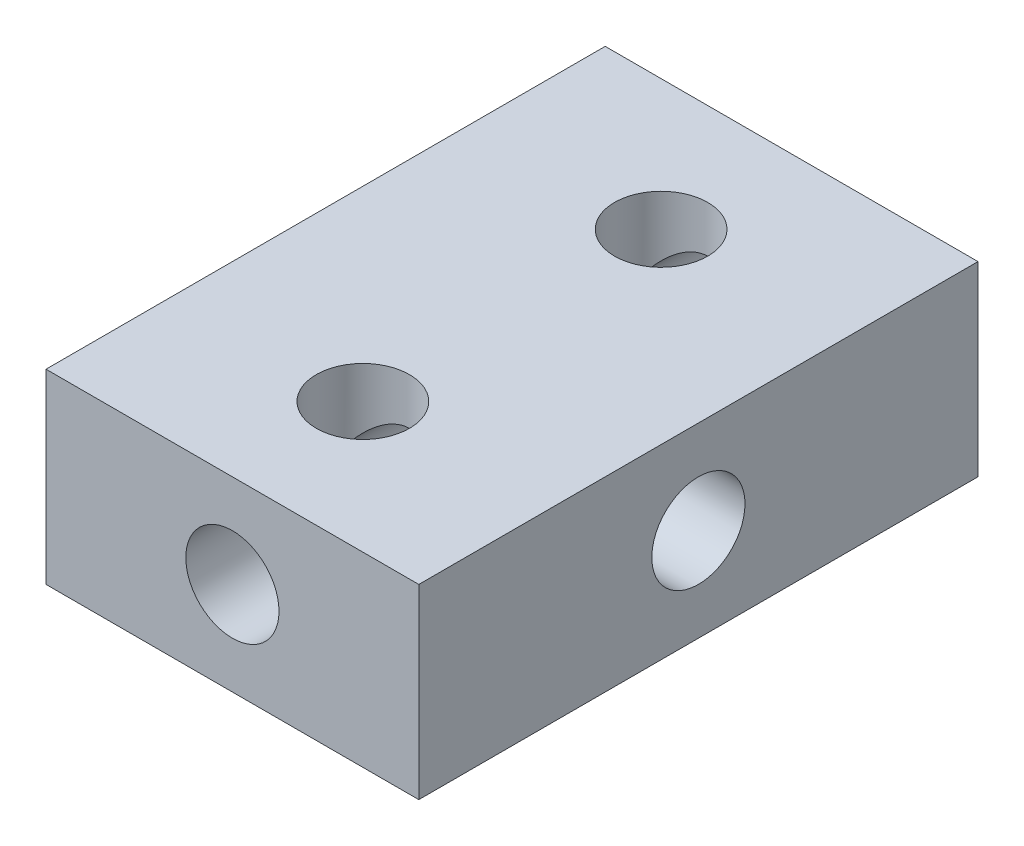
from build123d import *

# Parameters (mm, degrees)
ESQUISSE1_W       = 10
ESQUISSE1_H       = 5
EXTRUSION1_DEPTH  = 15
TROU_TARAUD_M31_D = 2.5
TROU_TARAUD_M32_D = 2.5
TROU_TARAUD_M33_D = 2.5


with BuildPart() as part:
    # Esquisse1 → Extrusion1 (new body)
    with BuildSketch(Plane.XY):
        with Locations((5, 2.5)):
            Rectangle(ESQUISSE1_W, ESQUISSE1_H)
    extrude(amount=EXTRUSION1_DEPTH)

    # Trou taraud_ M31 (through all)
    with Locations(Plane.XY.offset(15)):
        with Locations((5, 2.5)):
            Hole(TROU_TARAUD_M31_D / 2)

    # Trou taraud_ M32 (through all)
    with Locations(Plane(origin=(10, 0, 0), x_dir=(0, 0, -1), z_dir=(1, 0, 0))):
        with Locations((-7.5, 2.5)):
            Hole(TROU_TARAUD_M32_D / 2)

    # Trou taraud_ M33 (through all)
    with Locations(Plane(origin=(0, 5, 0), x_dir=(-1, 0, 0), z_dir=(0, 1, 0))):
        with Locations((-5, 11.5), (-5, 3.5)):
            Hole(TROU_TARAUD_M33_D / 2)


solid = part.part
